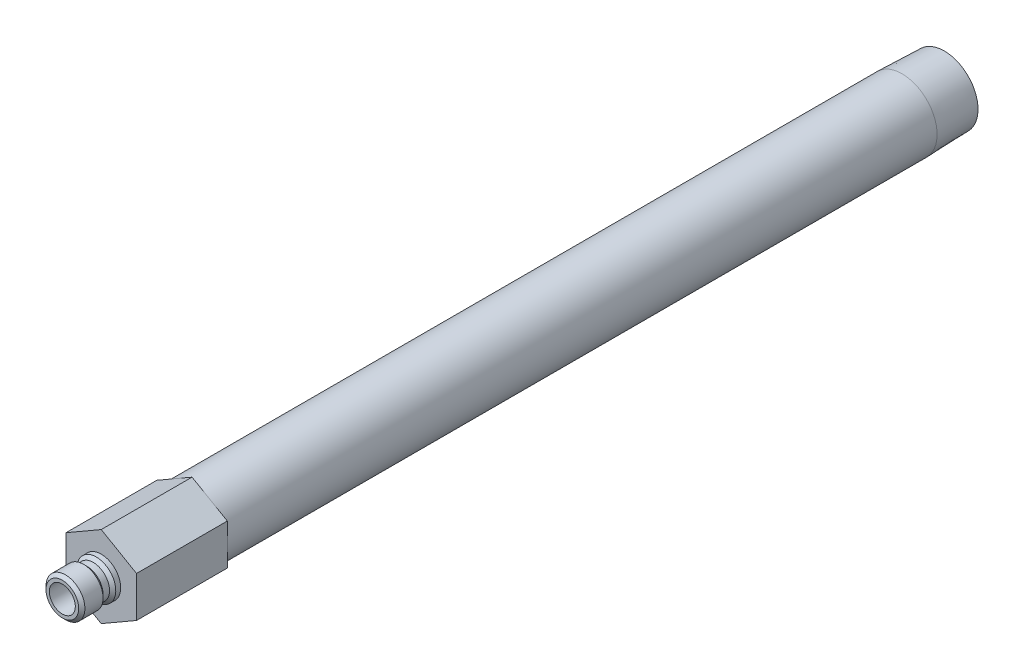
from build123d import *

# Parameters (mm, degrees)
SKETCH2_R           = 3.175
BOSS_EXTRUDE1_DEPTH = 22.225


with BuildPart() as part:
    # Sketch1 → Revolve1 (revolve)
    with BuildSketch(Plane(origin=(0, 0, 0), x_dir=(0, 0, -1), z_dir=(1, 0, 0))):
        Polygon((-9.525, 3.175), (-9.525, 4.0005), (-8.763, 4.7625), (-4.318, 4.7625), (-3.556, 4.0005), (-1.9685, 4.0005), (-1.2065, 4.7625), (0, 4.7625), (0, 8.5725), (196.0372, 8.5725), (206.375, 8.249445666), (206.375, 6.2611), (22.225, 6.2611), (22.225, 3.175), align=None)
    revolve(axis=Axis((0, 0, 0), (0, 0, 1)))

    # Sketch2 → Boss-Extrude1 (add)
    with BuildSketch(Plane.XY):
        Polygon((-8.636, 4.985996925), (-8.636, -4.985996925), (0, -9.971993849), (8.636, -4.985996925), (8.636, 4.985996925), (0, 9.971993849), align=None)
        with Locations(Location((0, 0, 0), (0, 0, 90))):
            Circle(SKETCH2_R, mode=Mode.SUBTRACT)
    extrude(amount=-BOSS_EXTRUDE1_DEPTH)


solid = part.part
